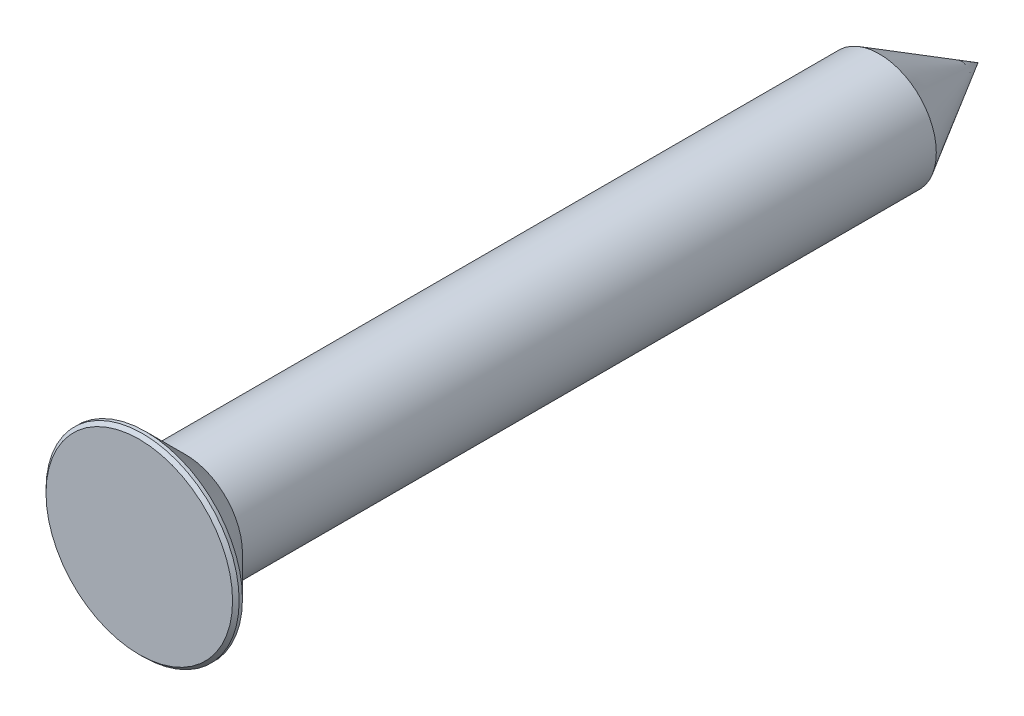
ISO-10303-21;
HEADER;
FILE_DESCRIPTION(('STEP AP214'),'2;1');
FILE_NAME('part.step','',(''),(''),'','','');
FILE_SCHEMA(('AUTOMOTIVE_DESIGN { 1 0 10303 214 1 1 1 1 }'));
ENDSEC;
DATA;
#1=APPLICATION_CONTEXT('core data for automotive mechanical design processes');
#2=APPLICATION_PROTOCOL_DEFINITION('international standard','automotive_design',2000,#1);
#3=PRODUCT_CONTEXT('',#1,'mechanical');
#4=PRODUCT('Part','Part','',(#3));
#5=PRODUCT_RELATED_PRODUCT_CATEGORY('part','',(#4));
#6=PRODUCT_DEFINITION_FORMATION('','',#4);
#7=PRODUCT_DEFINITION_CONTEXT('part definition',#1,'design');
#8=PRODUCT_DEFINITION('design','',#6,#7);
#9=PRODUCT_DEFINITION_SHAPE('','',#8);
#10=(LENGTH_UNIT() NAMED_UNIT(*) SI_UNIT(.MILLI.,.METRE.));
#11=(NAMED_UNIT(*) PLANE_ANGLE_UNIT() SI_UNIT($,.RADIAN.));
#12=(NAMED_UNIT(*) SI_UNIT($,.STERADIAN.) SOLID_ANGLE_UNIT());
#13=UNCERTAINTY_MEASURE_WITH_UNIT(LENGTH_MEASURE(1.E-05),#10,'distance_accuracy_value','');
#14=(GEOMETRIC_REPRESENTATION_CONTEXT(3) GLOBAL_UNCERTAINTY_ASSIGNED_CONTEXT((#13)) GLOBAL_UNIT_ASSIGNED_CONTEXT((#10,
#11,#12)) REPRESENTATION_CONTEXT('',''));
#15=CARTESIAN_POINT('',(0.,0.,0.));
#16=DIRECTION('',(0.,0.,1.));
#17=DIRECTION('',(1.,0.,0.));
#18=AXIS2_PLACEMENT_3D('',#15,#16,#17);
#19=CARTESIAN_POINT('',(0.,0.,-0.05));
#20=DIRECTION('',(0.,0.,-1.));
#21=DIRECTION('',(-1.,0.,0.));
#22=AXIS2_PLACEMENT_3D('',#19,#20,#21);
#23=CONICAL_SURFACE('',#22,1.4625,0.785398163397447);
#24=CARTESIAN_POINT('',(0.,0.,0.));
#25=DIRECTION('',(0.,0.,1.));
#26=DIRECTION('',(1.,0.,0.));
#27=AXIS2_PLACEMENT_3D('',#24,#25,#26);
#28=CIRCLE('',#27,1.4125);
#29=CARTESIAN_POINT('',(1.4125,0.,0.));
#30=VERTEX_POINT('',#29);
#31=EDGE_CURVE('E66',#30,#30,#28,.T.);
#32=ORIENTED_EDGE('',*,*,#31,.F.);
#33=EDGE_LOOP('',(#32));
#34=FACE_BOUND('',#33,.T.);
#35=CARTESIAN_POINT('',(0.,0.,-0.05));
#36=DIRECTION('',(0.,0.,1.));
#37=DIRECTION('',(1.,0.,0.));
#38=AXIS2_PLACEMENT_3D('',#35,#36,#37);
#39=CIRCLE('',#38,1.4625);
#40=CARTESIAN_POINT('',(1.4625,0.,-0.05));
#41=VERTEX_POINT('',#40);
#42=EDGE_CURVE('E11',#41,#41,#39,.T.);
#43=ORIENTED_EDGE('',*,*,#42,.T.);
#44=EDGE_LOOP('',(#43));
#45=FACE_BOUND('',#44,.T.);
#46=ADVANCED_FACE('F31',(#34,#45),#23,.T.);
#47=CARTESIAN_POINT('',(0.,0.,0.));
#48=DIRECTION('',(0.,0.,1.));
#49=DIRECTION('',(1.,0.,0.));
#50=AXIS2_PLACEMENT_3D('',#47,#48,#49);
#51=CYLINDRICAL_SURFACE('',#50,1.4625);
#52=ORIENTED_EDGE('',*,*,#42,.F.);
#53=EDGE_LOOP('',(#52));
#54=FACE_BOUND('',#53,.T.);
#55=CARTESIAN_POINT('',(0.,0.,-0.1));
#56=DIRECTION('',(0.,0.,1.));
#57=DIRECTION('',(1.,0.,0.));
#58=AXIS2_PLACEMENT_3D('',#55,#56,#57);
#59=CIRCLE('',#58,1.4625);
#60=CARTESIAN_POINT('',(1.4625,0.,-0.1));
#61=VERTEX_POINT('',#60);
#62=EDGE_CURVE('E37',#61,#61,#59,.T.);
#63=ORIENTED_EDGE('',*,*,#62,.T.);
#64=EDGE_LOOP('',(#63));
#65=FACE_BOUND('',#64,.T.);
#66=ADVANCED_FACE('F57',(#54,#65),#51,.T.);
#67=CARTESIAN_POINT('',(0.,0.,-0.700000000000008));
#68=DIRECTION('',(0.,0.,1.));
#69=DIRECTION('',(1.,0.,0.));
#70=AXIS2_PLACEMENT_3D('',#67,#68,#69);
#71=CONICAL_SURFACE('',#70,0.862499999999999,0.785398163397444);
#72=ORIENTED_EDGE('',*,*,#62,.F.);
#73=EDGE_LOOP('',(#72));
#74=FACE_BOUND('',#73,.T.);
#75=CARTESIAN_POINT('',(0.,0.,-0.700000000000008));
#76=DIRECTION('',(0.,0.,1.));
#77=DIRECTION('',(1.,0.,0.));
#78=AXIS2_PLACEMENT_3D('',#75,#76,#77);
#79=CIRCLE('',#78,0.862499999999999);
#80=CARTESIAN_POINT('',(0.862499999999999,0.,-0.700000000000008));
#81=VERTEX_POINT('',#80);
#82=EDGE_CURVE('E72',#81,#81,#79,.T.);
#83=ORIENTED_EDGE('',*,*,#82,.T.);
#84=EDGE_LOOP('',(#83));
#85=FACE_BOUND('',#84,.T.);
#86=ADVANCED_FACE('F52',(#74,#85),#71,.T.);
#87=CARTESIAN_POINT('',(0.,0.,0.));
#88=DIRECTION('',(0.,0.,1.));
#89=DIRECTION('',(1.,0.,0.));
#90=AXIS2_PLACEMENT_3D('',#87,#88,#89);
#91=CYLINDRICAL_SURFACE('',#90,0.8625);
#92=ORIENTED_EDGE('',*,*,#82,.F.);
#93=EDGE_LOOP('',(#92));
#94=FACE_BOUND('',#93,.T.);
#95=CARTESIAN_POINT('',(0.,0.,-11.2061061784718));
#96=DIRECTION('',(0.,0.,1.));
#97=DIRECTION('',(1.,0.,0.));
#98=AXIS2_PLACEMENT_3D('',#95,#96,#97);
#99=CIRCLE('',#98,0.8625);
#100=CARTESIAN_POINT('',(0.8625,0.,-11.2061061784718));
#101=VERTEX_POINT('',#100);
#102=EDGE_CURVE('E74',#101,#101,#99,.T.);
#103=ORIENTED_EDGE('',*,*,#102,.T.);
#104=EDGE_LOOP('',(#103));
#105=FACE_BOUND('',#104,.T.);
#106=ADVANCED_FACE('F43',(#94,#105),#91,.T.);
#107=CARTESIAN_POINT('',(0.,0.,-12.7));
#108=DIRECTION('',(0.,0.,1.));
#109=DIRECTION('',(1.,0.,0.));
#110=AXIS2_PLACEMENT_3D('',#107,#108,#109);
#111=CONICAL_SURFACE('',#110,0.,0.523598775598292);
#112=ORIENTED_EDGE('',*,*,#102,.F.);
#113=EDGE_LOOP('',(#112));
#114=FACE_BOUND('',#113,.T.);
#115=CARTESIAN_POINT('',(0.,0.,-12.7));
#116=VERTEX_POINT('',#115);
#117=VERTEX_LOOP('',#116);
#118=FACE_BOUND('',#117,.T.);
#119=ADVANCED_FACE('F40',(#114,#118),#111,.T.);
#120=CARTESIAN_POINT('',(0.,1.4125,0.));
#121=DIRECTION('',(0.,0.,-1.));
#122=DIRECTION('',(-1.,0.,0.));
#123=AXIS2_PLACEMENT_3D('',#120,#121,#122);
#124=PLANE('',#123);
#125=ORIENTED_EDGE('',*,*,#31,.T.);
#126=EDGE_LOOP('',(#125));
#127=FACE_BOUND('',#126,.T.);
#128=ADVANCED_FACE('F42',(#127),#124,.F.);
#129=CLOSED_SHELL('',(#46,#66,#86,#106,#119,#128));
#130=MANIFOLD_SOLID_BREP('B2',#129);
#131=ADVANCED_BREP_SHAPE_REPRESENTATION('',(#18,#130),#14);
#132=SHAPE_DEFINITION_REPRESENTATION(#9,#131);
ENDSEC;
END-ISO-10303-21;
